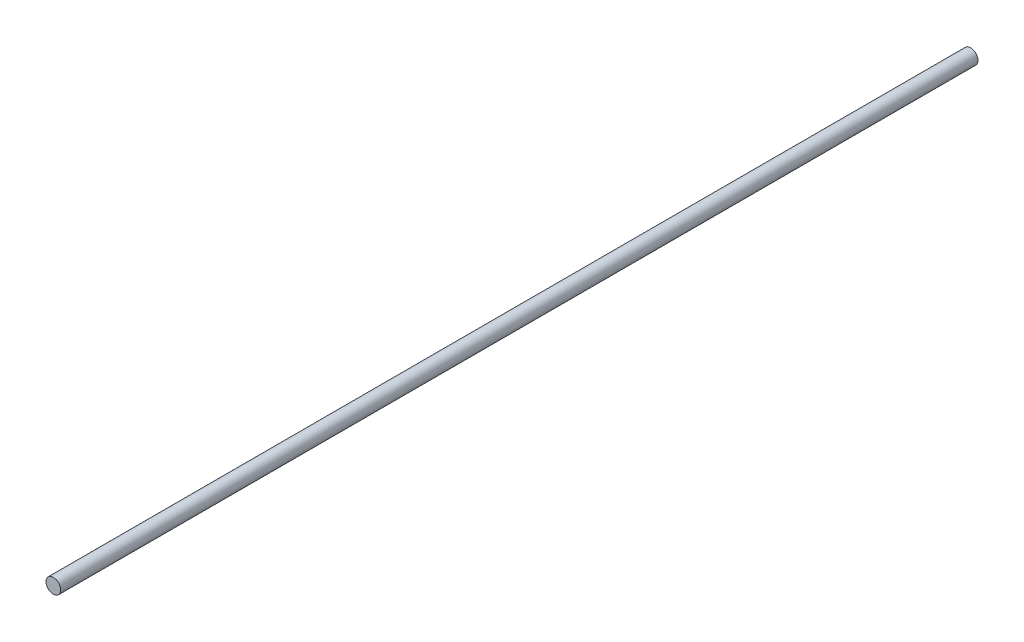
from build123d import *

# Parameters (mm, degrees)
SKETCH1_R           = 30
BOSS_EXTRUDE1_DEPTH = 3750


with BuildPart() as part:
    # Sketch1 → Boss-Extrude1 (new body)
    with BuildSketch(Plane.XY):
        Circle(SKETCH1_R)
    extrude(amount=-BOSS_EXTRUDE1_DEPTH)


solid = part.part
